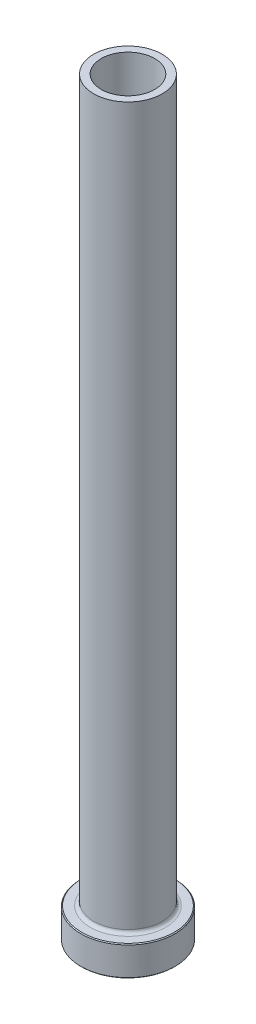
from build123d import *

# Parameters (mm, degrees)
FILLET1_R     = 0.8
CHAMFER1_SIZE = 0.2
CHAMFER3_SIZE = 0.5


with BuildPart() as part:
    # Sketch1 → Revolve1 (revolve)
    with BuildSketch(Plane.XY, mode=Mode.PRIVATE) as revolve1_sk:
        Polygon((-6.25, 175), (-8, 175), (-8, 7), (-11, 7), (-11, 0), (-6.5, 0), (-6.5, 108), (-6.25, 120), align=None)
    revolve(revolve1_sk.sketch.rotate(Axis((0, 92.187680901, 0), (0, -1, 0)), 270), axis=Axis((0, 92.187680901, 0), (0, -1, 0)))

    # Fillet1
    fillet1_edges = [part.edges().sort_by_distance(p)[0] for p in [
        (0, 7, -8),
    ]]
    fillet(fillet1_edges, radius=FILLET1_R)

    # Chamfer1
    chamfer1_edges = [part.edges().sort_by_distance(p)[0] for p in [
        (0, 0, -11),
        (0, 7, -11),
    ]]
    chamfer(chamfer1_edges, length=CHAMFER1_SIZE)

    # Chamfer3
    chamfer3_edges = [part.edges().sort_by_distance(p)[0] for p in [
        (0, 0, -6.5),
    ]]
    chamfer(chamfer3_edges, length=CHAMFER3_SIZE)


solid = part.part
